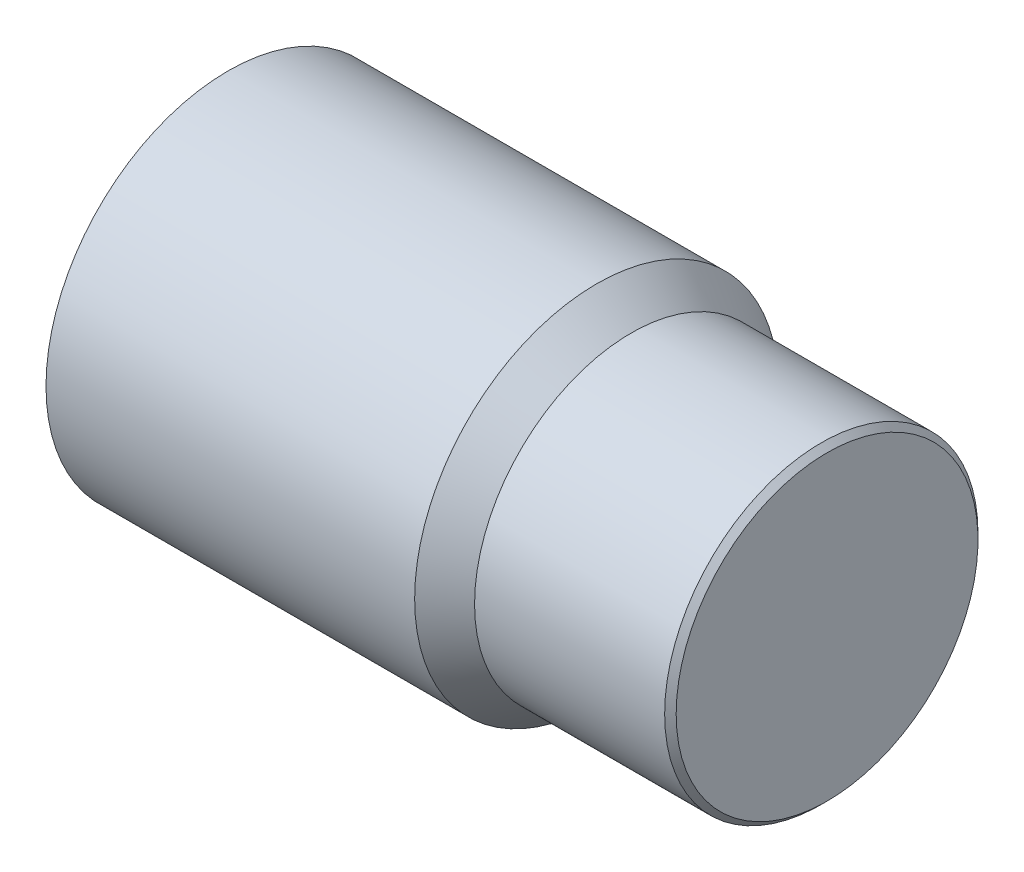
from build123d import *

# Parameters (mm, degrees)
SKETCH1_R           = 3.95
BOSS_EXTRUDE1_DEPTH = 8
CHAMFER1_SIZE       = 0.125


with BuildPart() as part:
    # Sketch1 → Boss-Extrude1 (new body)
    with BuildSketch(Plane(origin=(0, 0, 0), x_dir=(0, 0, -1), z_dir=(1, 0, 0))):
        Circle(SKETCH1_R)
    extrude(amount=BOSS_EXTRUDE1_DEPTH)

    # Sketch2 → Revolve1 (revolve)
    with BuildSketch(Plane(origin=(0, 0, 0), x_dir=(1, 0, 0), z_dir=(0, 1, 0)), mode=Mode.PRIVATE) as revolve1_sk:
        Polygon((8, 3.95), (8.75, 3.4), (13, 3.4), (13, 0), (8, 0), align=None)
    revolve(revolve1_sk.sketch.rotate(Axis((8, 0, 0), (1, 0, 0)), 180), axis=Axis((8, 0, 0), (1, 0, 0)))

    # Chamfer1
    chamfer1_edges = [part.edges().sort_by_distance(p)[0] for p in [
        (13, 0, -3.4),
    ]]
    chamfer(chamfer1_edges, length=CHAMFER1_SIZE)


solid = part.part
